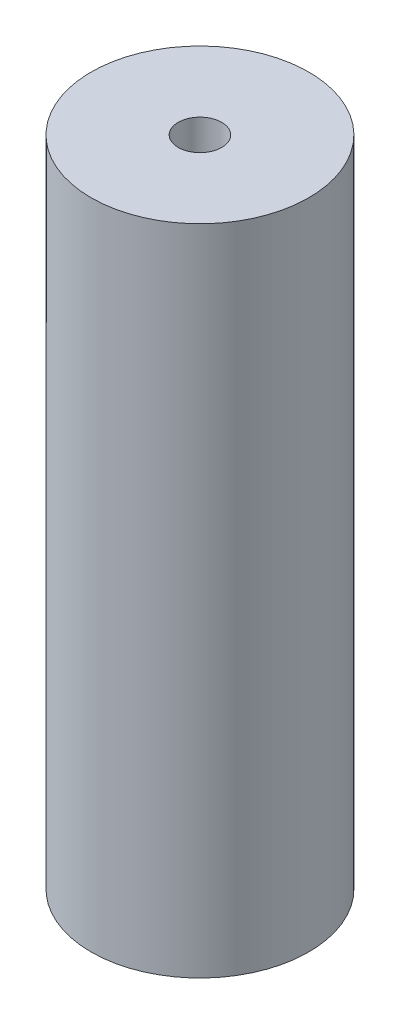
from build123d import *

# Parameters (mm, degrees)
SKETCH1_R                    = 10
EXTRUDE1_DEPTH               = 60
F_4_0_4_DIAMETER_HOLE1_D     = 4
F_4_0_4_DIAMETER_HOLE1_DEPTH = 25
F_4_0_4_DIAMETER_HOLE1_TIP   = 1.201721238


with BuildPart() as part:
    # Sketch1 → Extrude1 (new body)
    with BuildSketch(Plane(origin=(0, 0, 0), x_dir=(1, 0, 0), z_dir=(0, 1, 0))):
        with Locations(Location((0, 0, 0), (0, 0, 270))):
            Circle(SKETCH1_R)
    extrude(amount=EXTRUDE1_DEPTH)

    # 4.0 _4_ Diameter Hole1
    with Locations(Plane.ZX.offset(60)):
        with Locations((0, 0)):
            Hole(F_4_0_4_DIAMETER_HOLE1_D / 2, depth=F_4_0_4_DIAMETER_HOLE1_DEPTH)
            with Locations((0, 0, -(F_4_0_4_DIAMETER_HOLE1_DEPTH + F_4_0_4_DIAMETER_HOLE1_TIP / 2))):  # 118° drill point
                Cone(0, F_4_0_4_DIAMETER_HOLE1_D / 2, F_4_0_4_DIAMETER_HOLE1_TIP, mode=Mode.SUBTRACT)


solid = part.part
